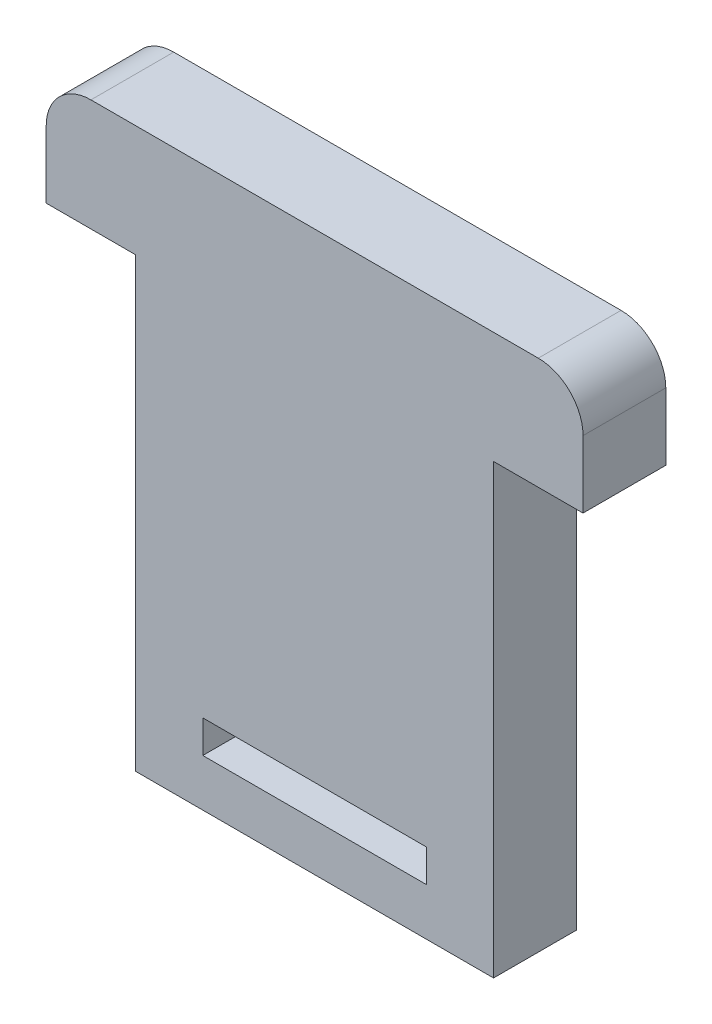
from build123d import *

# Parameters (mm, degrees)
BOSS_EXTRUDE1_DEPTH = 2.3495
SKETCH3_W           = 12.7
SKETCH3_H           = 1.85
CUT_EXTRUDE1_DEPTH  = 25.844329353
FILLET2_R           = 2.54


with BuildPart() as part:
    # Sketch2 → Boss-Extrude1 (new, symmetric)
    with BuildSketch(Plane.XY):
        Polygon((10.16, 12.7), (15.24, 12.7), (15.24, 19.05), (-15.24, 19.05), (-15.24, 12.7), (-10.16, 12.7), (-10.16, -12.7), (10.16, -12.7), align=None)
    extrude(amount=BOSS_EXTRUDE1_DEPTH, both=True)

    # Sketch3 → Cut-Extrude1 (cut, through all)
    with BuildSketch(Plane(origin=(0, 0, -2.3495), x_dir=(-1, 0, 0), z_dir=(0, 0, -1))):
        with Locations((0, -9.088)):
            Rectangle(SKETCH3_W, SKETCH3_H)
    extrude(amount=-CUT_EXTRUDE1_DEPTH, mode=Mode.SUBTRACT)

    # Fillet2
    fillet2_edges = [part.edges().sort_by_distance(p)[0] for p in [
        (-15.24, 19.05, 0),
        (15.24, 19.05, 0),
    ]]
    fillet(fillet2_edges, radius=FILLET2_R)


solid = part.part
